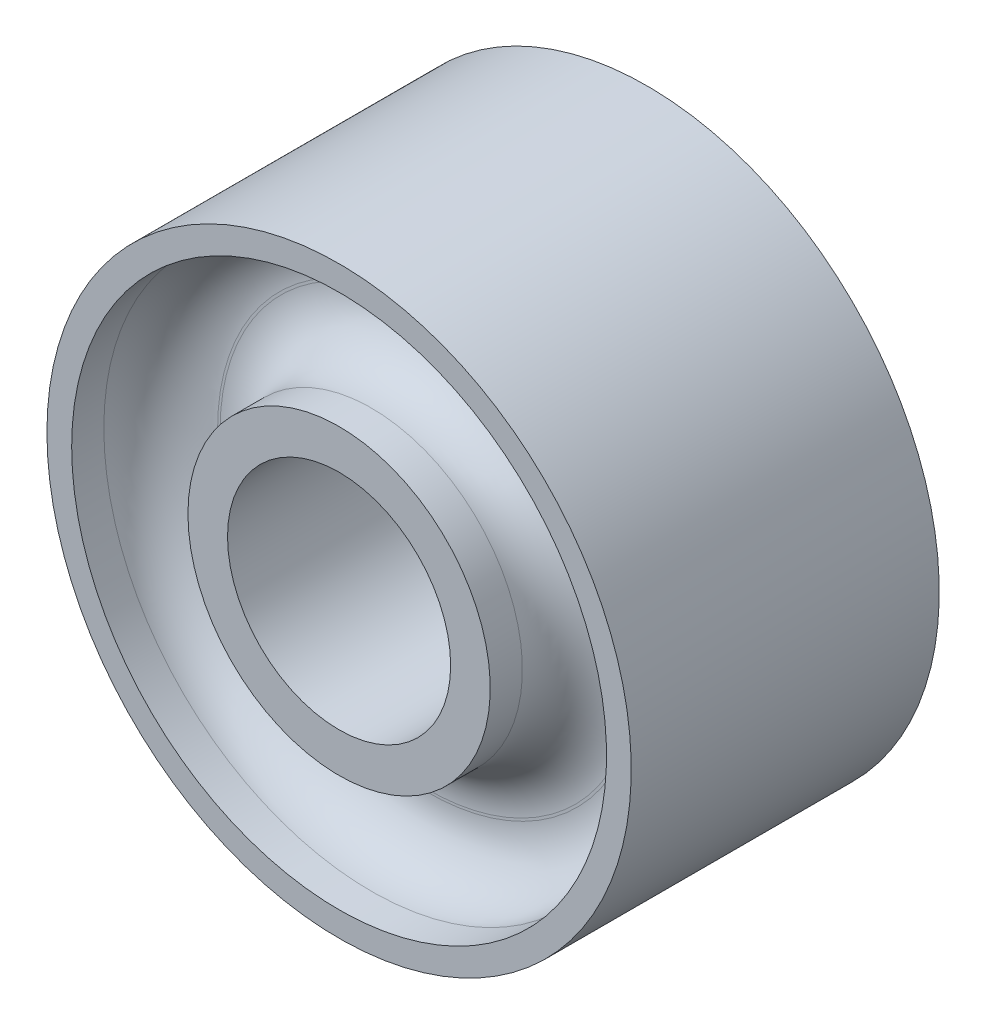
ISO-10303-21;
HEADER;
FILE_DESCRIPTION(('STEP AP214'),'2;1');
FILE_NAME('part.step','',(''),(''),'','','');
FILE_SCHEMA(('AUTOMOTIVE_DESIGN { 1 0 10303 214 1 1 1 1 }'));
ENDSEC;
DATA;
#1=APPLICATION_CONTEXT('core data for automotive mechanical design processes');
#2=APPLICATION_PROTOCOL_DEFINITION('international standard','automotive_design',2000,#1);
#3=PRODUCT_CONTEXT('',#1,'mechanical');
#4=PRODUCT('Part','Part','',(#3));
#5=PRODUCT_RELATED_PRODUCT_CATEGORY('part','',(#4));
#6=PRODUCT_DEFINITION_FORMATION('','',#4);
#7=PRODUCT_DEFINITION_CONTEXT('part definition',#1,'design');
#8=PRODUCT_DEFINITION('design','',#6,#7);
#9=PRODUCT_DEFINITION_SHAPE('','',#8);
#10=(LENGTH_UNIT() NAMED_UNIT(*) SI_UNIT(.MILLI.,.METRE.));
#11=(NAMED_UNIT(*) PLANE_ANGLE_UNIT() SI_UNIT($,.RADIAN.));
#12=(NAMED_UNIT(*) SI_UNIT($,.STERADIAN.) SOLID_ANGLE_UNIT());
#13=UNCERTAINTY_MEASURE_WITH_UNIT(LENGTH_MEASURE(1.E-05),#10,'distance_accuracy_value','');
#14=(GEOMETRIC_REPRESENTATION_CONTEXT(3) GLOBAL_UNCERTAINTY_ASSIGNED_CONTEXT((#13)) GLOBAL_UNIT_ASSIGNED_CONTEXT((#10,
#11,#12)) REPRESENTATION_CONTEXT('',''));
#15=CARTESIAN_POINT('',(0.,0.,0.));
#16=DIRECTION('',(0.,0.,1.));
#17=DIRECTION('',(1.,0.,0.));
#18=AXIS2_PLACEMENT_3D('',#15,#16,#17);
#19=CARTESIAN_POINT('',(0.,0.,0.));
#20=DIRECTION('',(0.,0.,-1.));
#21=DIRECTION('',(-1.,0.,0.));
#22=AXIS2_PLACEMENT_3D('',#19,#20,#21);
#23=CYLINDRICAL_SURFACE('',#22,11.4554);
#24=CARTESIAN_POINT('',(0.,0.,-15.8115));
#25=DIRECTION('',(0.,0.,-1.));
#26=DIRECTION('',(-1.,0.,0.));
#27=AXIS2_PLACEMENT_3D('',#24,#25,#26);
#28=CIRCLE('',#27,11.4554);
#29=CARTESIAN_POINT('',(-11.4554,0.,-15.8115));
#30=VERTEX_POINT('',#29);
#31=EDGE_CURVE('E46',#30,#30,#28,.F.);
#32=ORIENTED_EDGE('',*,*,#31,.F.);
#33=EDGE_LOOP('',(#32));
#34=FACE_BOUND('',#33,.T.);
#35=CARTESIAN_POINT('',(0.,0.,15.8115));
#36=DIRECTION('',(0.,0.,-1.));
#37=DIRECTION('',(-1.,0.,0.));
#38=AXIS2_PLACEMENT_3D('',#35,#36,#37);
#39=CIRCLE('',#38,11.4554);
#40=CARTESIAN_POINT('',(-11.4554,0.,15.8115));
#41=VERTEX_POINT('',#40);
#42=EDGE_CURVE('E17',#41,#41,#39,.T.);
#43=ORIENTED_EDGE('',*,*,#42,.F.);
#44=EDGE_LOOP('',(#43));
#45=FACE_BOUND('',#44,.T.);
#46=ADVANCED_FACE('F14',(#34,#45),#23,.F.);
#47=CARTESIAN_POINT('',(0.,11.4554,15.8115));
#48=DIRECTION('',(0.,0.,1.));
#49=DIRECTION('',(1.,0.,0.));
#50=AXIS2_PLACEMENT_3D('',#47,#48,#49);
#51=PLANE('',#50);
#52=ORIENTED_EDGE('',*,*,#42,.T.);
#53=EDGE_LOOP('',(#52));
#54=FACE_BOUND('',#53,.T.);
#55=CARTESIAN_POINT('',(0.,0.,15.8115));
#56=DIRECTION('',(0.,0.,-1.));
#57=DIRECTION('',(-1.,0.,0.));
#58=AXIS2_PLACEMENT_3D('',#55,#56,#57);
#59=CIRCLE('',#58,15.5194);
#60=CARTESIAN_POINT('',(-15.5194,0.,15.8115));
#61=VERTEX_POINT('',#60);
#62=EDGE_CURVE('E44',#61,#61,#59,.T.);
#63=ORIENTED_EDGE('',*,*,#62,.F.);
#64=EDGE_LOOP('',(#63));
#65=FACE_BOUND('',#64,.T.);
#66=ADVANCED_FACE('F53',(#54,#65),#51,.T.);
#67=CARTESIAN_POINT('',(0.,11.4554,-15.8115));
#68=DIRECTION('',(0.,0.,-1.));
#69=DIRECTION('',(-1.,0.,0.));
#70=AXIS2_PLACEMENT_3D('',#67,#68,#69);
#71=PLANE('',#70);
#72=ORIENTED_EDGE('',*,*,#31,.T.);
#73=EDGE_LOOP('',(#72));
#74=FACE_BOUND('',#73,.T.);
#75=CARTESIAN_POINT('',(0.,0.,-15.8115));
#76=DIRECTION('',(0.,0.,-1.));
#77=DIRECTION('',(-1.,0.,0.));
#78=AXIS2_PLACEMENT_3D('',#75,#76,#77);
#79=CIRCLE('',#78,15.5194);
#80=CARTESIAN_POINT('',(-15.5194,0.,-15.8115));
#81=VERTEX_POINT('',#80);
#82=EDGE_CURVE('E40',#81,#81,#79,.F.);
#83=ORIENTED_EDGE('',*,*,#82,.F.);
#84=EDGE_LOOP('',(#83));
#85=FACE_BOUND('',#84,.T.);
#86=ADVANCED_FACE('F62',(#74,#85),#71,.T.);
#87=CARTESIAN_POINT('',(0.,0.,0.));
#88=DIRECTION('',(0.,0.,-1.));
#89=DIRECTION('',(-1.,0.,0.));
#90=AXIS2_PLACEMENT_3D('',#87,#88,#89);
#91=CYLINDRICAL_SURFACE('',#90,15.5194);
#92=CARTESIAN_POINT('',(0.,0.,12.5095));
#93=DIRECTION('',(0.,0.,-1.));
#94=DIRECTION('',(-1.,0.,0.));
#95=AXIS2_PLACEMENT_3D('',#92,#93,#94);
#96=CIRCLE('',#95,15.5194);
#97=CARTESIAN_POINT('',(-15.5194,0.,12.5095));
#98=VERTEX_POINT('',#97);
#99=EDGE_CURVE('E43',#98,#98,#96,.F.);
#100=ORIENTED_EDGE('',*,*,#99,.T.);
#101=EDGE_LOOP('',(#100));
#102=FACE_BOUND('',#101,.T.);
#103=ORIENTED_EDGE('',*,*,#62,.T.);
#104=EDGE_LOOP('',(#103));
#105=FACE_BOUND('',#104,.T.);
#106=ADVANCED_FACE('F215',(#102,#105),#91,.T.);
#107=CARTESIAN_POINT('',(0.,0.,0.));
#108=DIRECTION('',(0.,0.,-1.));
#109=DIRECTION('',(-1.,0.,0.));
#110=AXIS2_PLACEMENT_3D('',#107,#108,#109);
#111=CYLINDRICAL_SURFACE('',#110,15.5194);
#112=ORIENTED_EDGE('',*,*,#82,.T.);
#113=EDGE_LOOP('',(#112));
#114=FACE_BOUND('',#113,.T.);
#115=CARTESIAN_POINT('',(0.,0.,-12.5095));
#116=DIRECTION('',(0.,0.,-1.));
#117=DIRECTION('',(-1.,0.,0.));
#118=AXIS2_PLACEMENT_3D('',#115,#116,#117);
#119=CIRCLE('',#118,15.5194);
#120=CARTESIAN_POINT('',(-15.5194,0.,-12.5095));
#121=VERTEX_POINT('',#120);
#122=EDGE_CURVE('E182',#121,#121,#119,.T.);
#123=ORIENTED_EDGE('',*,*,#122,.T.);
#124=EDGE_LOOP('',(#123));
#125=FACE_BOUND('',#124,.T.);
#126=ADVANCED_FACE('F212',(#114,#125),#111,.T.);
#127=CARTESIAN_POINT('',(0.,0.,12.5095));
#128=DIRECTION('',(0.,0.,-1.));
#129=DIRECTION('',(-1.,0.,0.));
#130=AXIS2_PLACEMENT_3D('',#127,#128,#129);
#131=TOROIDAL_SURFACE('',#130,21.3614,5.842);
#132=ORIENTED_EDGE('',*,*,#99,.F.);
#133=EDGE_LOOP('',(#132));
#134=FACE_BOUND('',#133,.T.);
#135=CARTESIAN_POINT('',(0.,0.,6.6675));
#136=DIRECTION('',(0.,0.,1.));
#137=DIRECTION('',(-1.,0.,0.));
#138=AXIS2_PLACEMENT_3D('',#135,#136,#137);
#139=CIRCLE('',#138,21.3614);
#140=CARTESIAN_POINT('',(-21.3614,0.,6.6675));
#141=VERTEX_POINT('',#140);
#142=EDGE_CURVE('E161',#141,#141,#139,.F.);
#143=ORIENTED_EDGE('',*,*,#142,.F.);
#144=EDGE_LOOP('',(#143));
#145=FACE_BOUND('',#144,.T.);
#146=ADVANCED_FACE('F187',(#134,#145),#131,.F.);
#147=CARTESIAN_POINT('',(0.,0.,-12.5095));
#148=DIRECTION('',(0.,0.,-1.));
#149=DIRECTION('',(-1.,0.,0.));
#150=AXIS2_PLACEMENT_3D('',#147,#148,#149);
#151=TOROIDAL_SURFACE('',#150,21.3614,5.842);
#152=CARTESIAN_POINT('',(0.,0.,-6.6675));
#153=DIRECTION('',(0.,0.,-1.));
#154=DIRECTION('',(-1.,0.,0.));
#155=AXIS2_PLACEMENT_3D('',#152,#153,#154);
#156=CIRCLE('',#155,21.3614);
#157=CARTESIAN_POINT('',(-21.3614,0.,-6.6675));
#158=VERTEX_POINT('',#157);
#159=EDGE_CURVE('E208',#158,#158,#156,.F.);
#160=ORIENTED_EDGE('',*,*,#159,.F.);
#161=EDGE_LOOP('',(#160));
#162=FACE_BOUND('',#161,.T.);
#163=ORIENTED_EDGE('',*,*,#122,.F.);
#164=EDGE_LOOP('',(#163));
#165=FACE_BOUND('',#164,.T.);
#166=ADVANCED_FACE('F184',(#162,#165),#151,.F.);
#167=CARTESIAN_POINT('',(0.,21.3614,6.6675));
#168=DIRECTION('',(0.,0.,1.));
#169=DIRECTION('',(1.,0.,0.));
#170=AXIS2_PLACEMENT_3D('',#167,#168,#169);
#171=PLANE('',#170);
#172=ORIENTED_EDGE('',*,*,#142,.T.);
#173=EDGE_LOOP('',(#172));
#174=FACE_BOUND('',#173,.T.);
#175=CARTESIAN_POINT('',(0.,0.,6.6675));
#176=DIRECTION('',(0.,0.,-1.));
#177=DIRECTION('',(-1.,0.,0.));
#178=AXIS2_PLACEMENT_3D('',#175,#176,#177);
#179=CIRCLE('',#178,21.6154);
#180=CARTESIAN_POINT('',(-21.6154,0.,6.6675));
#181=VERTEX_POINT('',#180);
#182=EDGE_CURVE('E148',#181,#181,#179,.F.);
#183=ORIENTED_EDGE('',*,*,#182,.T.);
#184=EDGE_LOOP('',(#183));
#185=FACE_BOUND('',#184,.T.);
#186=ADVANCED_FACE('F122',(#174,#185),#171,.T.);
#187=CARTESIAN_POINT('',(0.,21.3614,-6.6675));
#188=DIRECTION('',(0.,0.,-1.));
#189=DIRECTION('',(-1.,0.,0.));
#190=AXIS2_PLACEMENT_3D('',#187,#188,#189);
#191=PLANE('',#190);
#192=ORIENTED_EDGE('',*,*,#159,.T.);
#193=EDGE_LOOP('',(#192));
#194=FACE_BOUND('',#193,.T.);
#195=CARTESIAN_POINT('',(0.,0.,-6.6675));
#196=DIRECTION('',(0.,0.,1.));
#197=DIRECTION('',(-1.,0.,0.));
#198=AXIS2_PLACEMENT_3D('',#195,#196,#197);
#199=CIRCLE('',#198,21.6154);
#200=CARTESIAN_POINT('',(-21.6154,0.,-6.6675));
#201=VERTEX_POINT('',#200);
#202=EDGE_CURVE('E107',#201,#201,#199,.F.);
#203=ORIENTED_EDGE('',*,*,#202,.T.);
#204=EDGE_LOOP('',(#203));
#205=FACE_BOUND('',#204,.T.);
#206=ADVANCED_FACE('F113',(#194,#205),#191,.T.);
#207=CARTESIAN_POINT('',(0.,0.,12.5095));
#208=DIRECTION('',(0.,0.,-1.));
#209=DIRECTION('',(-1.,0.,0.));
#210=AXIS2_PLACEMENT_3D('',#207,#208,#209);
#211=TOROIDAL_SURFACE('',#210,21.6154,5.842);
#212=ORIENTED_EDGE('',*,*,#182,.F.);
#213=EDGE_LOOP('',(#212));
#214=FACE_BOUND('',#213,.T.);
#215=CARTESIAN_POINT('',(0.,0.,12.5095));
#216=DIRECTION('',(0.,0.,-1.));
#217=DIRECTION('',(-1.,0.,0.));
#218=AXIS2_PLACEMENT_3D('',#215,#216,#217);
#219=CIRCLE('',#218,27.4574);
#220=CARTESIAN_POINT('',(-27.4574,0.,12.5095));
#221=VERTEX_POINT('',#220);
#222=EDGE_CURVE('E292',#221,#221,#219,.F.);
#223=ORIENTED_EDGE('',*,*,#222,.T.);
#224=EDGE_LOOP('',(#223));
#225=FACE_BOUND('',#224,.T.);
#226=ADVANCED_FACE('F91',(#214,#225),#211,.F.);
#227=CARTESIAN_POINT('',(0.,0.,-12.5095));
#228=DIRECTION('',(0.,0.,-1.));
#229=DIRECTION('',(-1.,0.,0.));
#230=AXIS2_PLACEMENT_3D('',#227,#228,#229);
#231=TOROIDAL_SURFACE('',#230,21.6154,5.842);
#232=CARTESIAN_POINT('',(0.,0.,-12.5095));
#233=DIRECTION('',(0.,0.,-1.));
#234=DIRECTION('',(-1.,0.,0.));
#235=AXIS2_PLACEMENT_3D('',#232,#233,#234);
#236=CIRCLE('',#235,27.4574);
#237=CARTESIAN_POINT('',(-27.4574,0.,-12.5095));
#238=VERTEX_POINT('',#237);
#239=EDGE_CURVE('E39',#238,#238,#236,.T.);
#240=ORIENTED_EDGE('',*,*,#239,.T.);
#241=EDGE_LOOP('',(#240));
#242=FACE_BOUND('',#241,.T.);
#243=ORIENTED_EDGE('',*,*,#202,.F.);
#244=EDGE_LOOP('',(#243));
#245=FACE_BOUND('',#244,.T.);
#246=ADVANCED_FACE('F85',(#242,#245),#231,.F.);
#247=CARTESIAN_POINT('',(0.,0.,0.));
#248=DIRECTION('',(0.,0.,-1.));
#249=DIRECTION('',(-1.,0.,0.));
#250=AXIS2_PLACEMENT_3D('',#247,#248,#249);
#251=CYLINDRICAL_SURFACE('',#250,27.4574);
#252=ORIENTED_EDGE('',*,*,#222,.F.);
#253=EDGE_LOOP('',(#252));
#254=FACE_BOUND('',#253,.T.);
#255=CARTESIAN_POINT('',(0.,0.,15.8115));
#256=DIRECTION('',(0.,0.,-1.));
#257=DIRECTION('',(-1.,0.,0.));
#258=AXIS2_PLACEMENT_3D('',#255,#256,#257);
#259=CIRCLE('',#258,27.4574);
#260=CARTESIAN_POINT('',(-27.4574,0.,15.8115));
#261=VERTEX_POINT('',#260);
#262=EDGE_CURVE('E36',#261,#261,#259,.T.);
#263=ORIENTED_EDGE('',*,*,#262,.F.);
#264=EDGE_LOOP('',(#263));
#265=FACE_BOUND('',#264,.T.);
#266=ADVANCED_FACE('F81',(#254,#265),#251,.F.);
#267=CARTESIAN_POINT('',(0.,0.,0.));
#268=DIRECTION('',(0.,0.,-1.));
#269=DIRECTION('',(-1.,0.,0.));
#270=AXIS2_PLACEMENT_3D('',#267,#268,#269);
#271=CYLINDRICAL_SURFACE('',#270,27.4574);
#272=CARTESIAN_POINT('',(0.,0.,-15.8115));
#273=DIRECTION('',(0.,0.,-1.));
#274=DIRECTION('',(-1.,0.,0.));
#275=AXIS2_PLACEMENT_3D('',#272,#273,#274);
#276=CIRCLE('',#275,27.4574);
#277=CARTESIAN_POINT('',(-27.4574,0.,-15.8115));
#278=VERTEX_POINT('',#277);
#279=EDGE_CURVE('E26',#278,#278,#276,.F.);
#280=ORIENTED_EDGE('',*,*,#279,.F.);
#281=EDGE_LOOP('',(#280));
#282=FACE_BOUND('',#281,.T.);
#283=ORIENTED_EDGE('',*,*,#239,.F.);
#284=EDGE_LOOP('',(#283));
#285=FACE_BOUND('',#284,.T.);
#286=ADVANCED_FACE('F77',(#282,#285),#271,.F.);
#287=CARTESIAN_POINT('',(0.,27.4574,15.8115));
#288=DIRECTION('',(0.,0.,1.));
#289=DIRECTION('',(1.,0.,0.));
#290=AXIS2_PLACEMENT_3D('',#287,#288,#289);
#291=PLANE('',#290);
#292=ORIENTED_EDGE('',*,*,#262,.T.);
#293=EDGE_LOOP('',(#292));
#294=FACE_BOUND('',#293,.T.);
#295=CARTESIAN_POINT('',(0.,0.,15.8115));
#296=DIRECTION('',(0.,0.,-1.));
#297=DIRECTION('',(-1.,0.,0.));
#298=AXIS2_PLACEMENT_3D('',#295,#296,#297);
#299=CIRCLE('',#298,29.9974);
#300=CARTESIAN_POINT('',(-29.9974,0.,15.8115));
#301=VERTEX_POINT('',#300);
#302=EDGE_CURVE('E21',#301,#301,#299,.T.);
#303=ORIENTED_EDGE('',*,*,#302,.F.);
#304=EDGE_LOOP('',(#303));
#305=FACE_BOUND('',#304,.T.);
#306=ADVANCED_FACE('F70',(#294,#305),#291,.T.);
#307=CARTESIAN_POINT('',(0.,27.4574,-15.8115));
#308=DIRECTION('',(0.,0.,-1.));
#309=DIRECTION('',(-1.,0.,0.));
#310=AXIS2_PLACEMENT_3D('',#307,#308,#309);
#311=PLANE('',#310);
#312=ORIENTED_EDGE('',*,*,#279,.T.);
#313=EDGE_LOOP('',(#312));
#314=FACE_BOUND('',#313,.T.);
#315=CARTESIAN_POINT('',(0.,0.,-15.8115));
#316=DIRECTION('',(0.,0.,-1.));
#317=DIRECTION('',(-1.,0.,0.));
#318=AXIS2_PLACEMENT_3D('',#315,#316,#317);
#319=CIRCLE('',#318,29.9974);
#320=CARTESIAN_POINT('',(-29.9974,0.,-15.8115));
#321=VERTEX_POINT('',#320);
#322=EDGE_CURVE('E10',#321,#321,#319,.F.);
#323=ORIENTED_EDGE('',*,*,#322,.F.);
#324=EDGE_LOOP('',(#323));
#325=FACE_BOUND('',#324,.T.);
#326=ADVANCED_FACE('F65',(#314,#325),#311,.T.);
#327=CARTESIAN_POINT('',(0.,0.,0.));
#328=DIRECTION('',(0.,0.,-1.));
#329=DIRECTION('',(-1.,0.,0.));
#330=AXIS2_PLACEMENT_3D('',#327,#328,#329);
#331=CYLINDRICAL_SURFACE('',#330,29.9974);
#332=ORIENTED_EDGE('',*,*,#322,.T.);
#333=EDGE_LOOP('',(#332));
#334=FACE_BOUND('',#333,.T.);
#335=ORIENTED_EDGE('',*,*,#302,.T.);
#336=EDGE_LOOP('',(#335));
#337=FACE_BOUND('',#336,.T.);
#338=ADVANCED_FACE('F63',(#334,#337),#331,.T.);
#339=CLOSED_SHELL('',(#46,#66,#86,#106,#126,#146,#166,#186,#206,#226,#246,#266,#286,#306,#326,#338));
#340=MANIFOLD_SOLID_BREP('B1',#339);
#341=ADVANCED_BREP_SHAPE_REPRESENTATION('',(#18,#340),#14);
#342=SHAPE_DEFINITION_REPRESENTATION(#9,#341);
ENDSEC;
END-ISO-10303-21;
